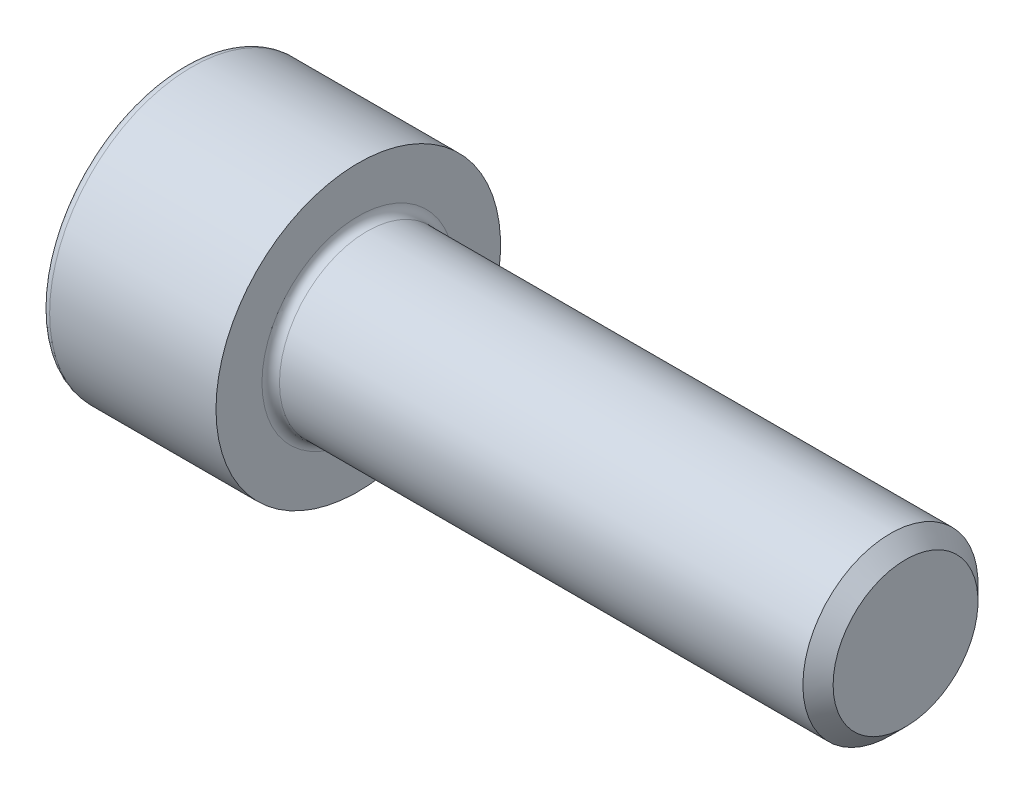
from build123d import *

# Parameters (mm, degrees)
FILLET1_R   = 0.4
FILLET2_R   = 0.4
HEX_2_DEPTH = 4


with BuildPart() as part:
    # BodySke → Base-Revolve (revolve)
    with BuildSketch(Plane.XY, mode=Mode.PRIVATE) as base_revolve_sk:
        Polygon((0, 0), (0, 6.5), (8, 6.5), (8, 4), (32.3095, 4), (33, 3.3095), (33, 0), align=None)
    revolve(base_revolve_sk.sketch.rotate(Axis((-31.75, 0, 0), (1, 0, 0)), 90), axis=Axis((-31.75, 0, 0), (1, 0, 0)))

    # Fillet1
    fillet1_edges = [part.edges().sort_by_distance(p)[0] for p in [
        (8, 0, -4),
    ]]
    fillet(fillet1_edges, radius=FILLET1_R)

    # Fillet2
    fillet2_edges = [part.edges().sort_by_distance(p)[0] for p in [
        (0, 0, -6.5),
    ]]
    fillet(fillet2_edges, radius=FILLET2_R)

    # Sketch2 → Hex-PreBroach (revolve, cut)
    with BuildSketch(Plane.XY, mode=Mode.PRIVATE) as hex_prebroach_sk:
        Polygon((0, 3.0475), (4, 3.0475), (5.759474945, 0), (0, 0), align=None)
    revolve(hex_prebroach_sk.sketch.rotate(Axis((0, 0, 0), (1, 0, 0)), 90), axis=Axis((0, 0, 0), (1, 0, 0)), mode=Mode.SUBTRACT)

    # Sketch3 → Hex 2 (cut)
    with BuildSketch(Plane(origin=(0, 0, 0), x_dir=(0, 0.500000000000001, 0.866025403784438), z_dir=(-1, 0, 0))):
        Polygon((1.759474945, 3.0475), (-1.759474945, 3.0475), (-3.518949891, 0), (-1.759474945, -3.0475), (1.759474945, -3.0475), (3.518949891, 0), align=None)
    extrude(amount=-HEX_2_DEPTH, mode=Mode.SUBTRACT)


solid = part.part
